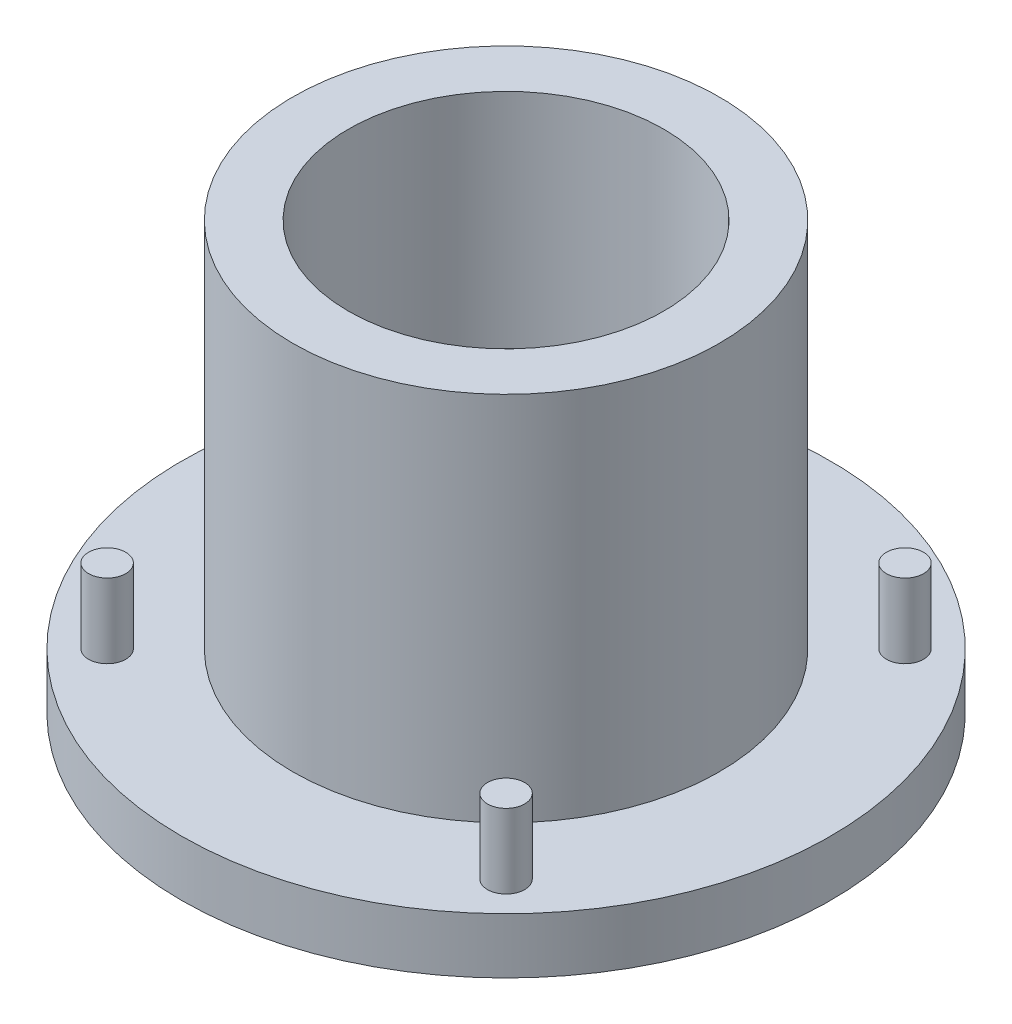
from build123d import *

# Parameters (mm, degrees)
SKETCH1_R           = 17.5
BOSS_EXTRUDE2_DEPTH = 3
SKETCH2_R           = 1
BOSS_EXTRUDE3_DEPTH = 4
SKETCH3_R           = 11.5
SKETCH3_R_2         = 8.5
BOSS_EXTRUDE4_DEPTH = 20
SKETCH4_R           = 9.5
BOSS_EXTRUDE5_DEPTH = 8
SKETCH5_R           = 2.25
CUT_EXTRUDE1_DEPTH  = 28.504545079


with BuildPart() as part:
    # Sketch1 → Boss-Extrude2 (new body)
    with BuildSketch(Plane(origin=(0, 0, 0), x_dir=(1, 0, 0), z_dir=(0, 1, 0))):
        with Locations(Location((0, 0, 0), (0, 0, 270))):
            Circle(SKETCH1_R)
    extrude(amount=-BOSS_EXTRUDE2_DEPTH)

    # Sketch2 → Boss-Extrude3 (add)
    with BuildSketch(Plane(origin=(0, 0, 0), x_dir=(1, 0, 0), z_dir=(0, 1, 0))):
        with Locations(Location((-10.75, -10.75, 0), (0, 0, 270))):
            Circle(SKETCH2_R)
        with Locations(Location((-10.75, 10.75, 0), (0, 0, 270))):
            Circle(SKETCH2_R)
        with Locations(Location((10.75, 10.75, 0), (0, 0, 270))):
            Circle(SKETCH2_R)
        with Locations(Location((10.75, -10.75, 0), (0, 0, 270))):
            Circle(SKETCH2_R)
    extrude(amount=BOSS_EXTRUDE3_DEPTH)

    # Sketch3 → Boss-Extrude4 (add)
    with BuildSketch(Plane(origin=(0, 0, 0), x_dir=(1, 0, 0), z_dir=(0, 1, 0))):
        with Locations(Location((0, 0, 0), (0, 0, 270))):
            Circle(SKETCH3_R)
        with Locations(Location((0, 0, 0), (0, 0, 270))):
            Circle(SKETCH3_R_2, mode=Mode.SUBTRACT)
    extrude(amount=BOSS_EXTRUDE4_DEPTH)

    # Sketch4 → Boss-Extrude5 (add)
    with BuildSketch(Plane(origin=(0, 0, 0), x_dir=(1, 0, 0), z_dir=(0, 1, 0))):
        Circle(SKETCH4_R)
    extrude(amount=BOSS_EXTRUDE5_DEPTH)

    # Sketch5 → Cut-Extrude1 (cut, through all)
    with BuildSketch(Plane(origin=(0, 8, 0), x_dir=(1, 0, 0), z_dir=(0, 1, 0))):
        with Locations(Location((0, 0, 0), (0, 0, 270))):
            Circle(SKETCH5_R)
    extrude(amount=-CUT_EXTRUDE1_DEPTH, mode=Mode.SUBTRACT)


solid = part.part
